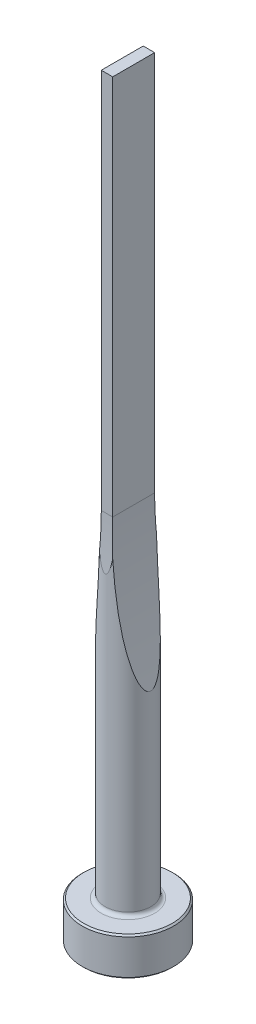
from build123d import *

# Parameters (mm, degrees)
CUT_EXTRUDE1_DEPTH = 5
CUT_EXTRUDE2_DEPTH = 5


with BuildPart() as part:
    # Sketch1 → Revolve1 (revolve)
    with BuildSketch(Plane.XY, mode=Mode.PRIVATE) as revolve1_sk:
        with BuildLine():
            Line((0, 0), (5.8, 0))
            Line((5.8, 0), (6, 0.2))
            Line((6, 0.2), (6, 4.8))
            Line((6, 4.8), (5.8, 5))
            Line((5.8, 5), (3.5, 5))
            ThreePointArc((3.5, 5), (3.146446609, 5.146446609), (3, 5.5))
            Line((3, 5.5), (3, 100))
            Line((3, 100), (0, 100))
            Line((0, 100), (0, 0))
        make_face()
    revolve(revolve1_sk.sketch.rotate(Axis((0, 100, 0), (0, -1, 0)), 180), axis=Axis((0, 100, 0), (0, -1, 0)))

    # Sketch2 → Cut-Extrude1 (cut, symmetric)
    with BuildSketch(Plane.XY):
        with BuildLine():
            Line((0.75, 100), (0.75, 50))
            ThreePointArc((0.75, 50), (1.314268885, 39.937694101), (3, 30.001562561))
            Line((3, 30.001562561), (3, 100))
            Line((3, 100), (0.75, 100))
        make_face()
        with BuildLine():
            Line((-0.75, 100), (-0.75, 50))
            ThreePointArc((-0.75, 50), (-1.314268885, 39.937694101), (-3, 30.001562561))
            Line((-3, 30.001562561), (-3, 100))
            Line((-3, 100), (-0.75, 100))
        make_face()
    extrude(amount=CUT_EXTRUDE1_DEPTH, both=True, mode=Mode.SUBTRACT)

    # Sketch3 → Cut-Extrude2 (cut, symmetric)
    with BuildSketch(Plane(origin=(0, 0, 0), x_dir=(0, 0, -1), z_dir=(1, 0, 0))):
        with BuildLine():
            Line((2.75, 100), (2.75, 50))
            ThreePointArc((2.75, 50), (2.812521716, 46.645898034), (3, 43.296456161))
            Line((3, 43.296456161), (3, 100))
            Line((3, 100), (2.75, 100))
        make_face()
        with BuildLine():
            Line((-2.75, 100), (-2.75, 50))
            ThreePointArc((-2.75, 50), (-2.812521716, 46.645898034), (-3, 43.296456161))
            Line((-3, 43.296456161), (-3, 100))
            Line((-3, 100), (-2.75, 100))
        make_face()
    extrude(amount=CUT_EXTRUDE2_DEPTH, both=True, mode=Mode.SUBTRACT)


solid = part.part
